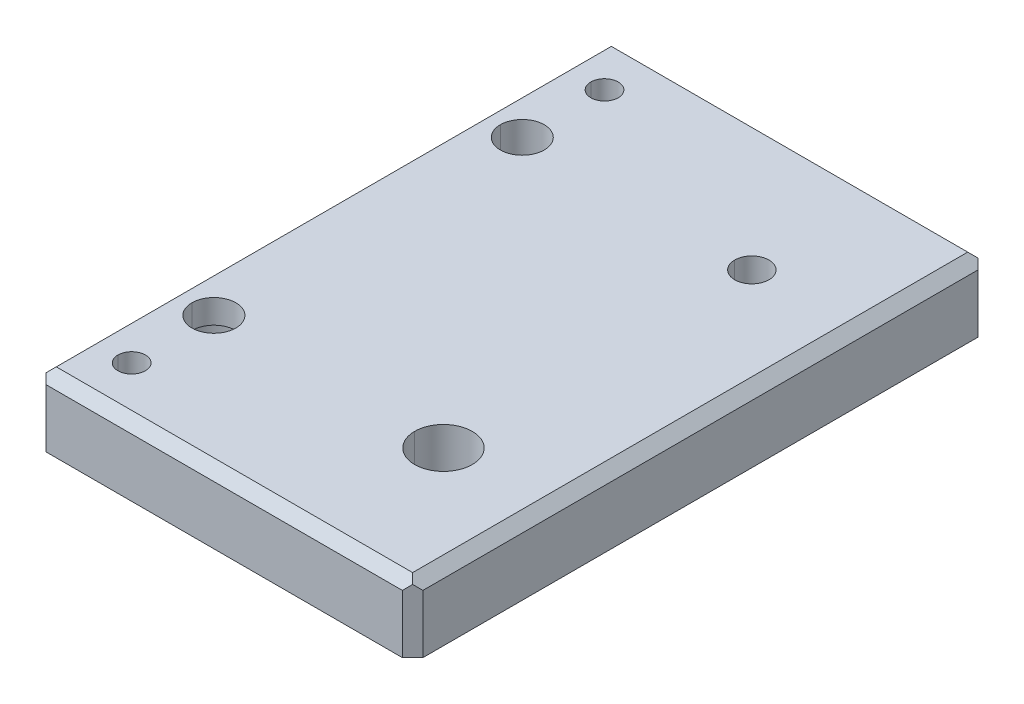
ISO-10303-21;
HEADER;
FILE_DESCRIPTION(('STEP AP214'),'2;1');
FILE_NAME('part.step','',(''),(''),'','','');
FILE_SCHEMA(('AUTOMOTIVE_DESIGN { 1 0 10303 214 1 1 1 1 }'));
ENDSEC;
DATA;
#1=APPLICATION_CONTEXT('core data for automotive mechanical design processes');
#2=APPLICATION_PROTOCOL_DEFINITION('international standard','automotive_design',2000,#1);
#3=PRODUCT_CONTEXT('',#1,'mechanical');
#4=PRODUCT('Part','Part','',(#3));
#5=PRODUCT_RELATED_PRODUCT_CATEGORY('part','',(#4));
#6=PRODUCT_DEFINITION_FORMATION('','',#4);
#7=PRODUCT_DEFINITION_CONTEXT('part definition',#1,'design');
#8=PRODUCT_DEFINITION('design','',#6,#7);
#9=PRODUCT_DEFINITION_SHAPE('','',#8);
#10=(LENGTH_UNIT() NAMED_UNIT(*) SI_UNIT(.MILLI.,.METRE.));
#11=(NAMED_UNIT(*) PLANE_ANGLE_UNIT() SI_UNIT($,.RADIAN.));
#12=(NAMED_UNIT(*) SI_UNIT($,.STERADIAN.) SOLID_ANGLE_UNIT());
#13=UNCERTAINTY_MEASURE_WITH_UNIT(LENGTH_MEASURE(1.E-05),#10,'distance_accuracy_value','');
#14=(GEOMETRIC_REPRESENTATION_CONTEXT(3) GLOBAL_UNCERTAINTY_ASSIGNED_CONTEXT((#13)) GLOBAL_UNIT_ASSIGNED_CONTEXT((#10,
#11,#12)) REPRESENTATION_CONTEXT('',''));
#15=CARTESIAN_POINT('',(0.,0.,0.));
#16=DIRECTION('',(0.,0.,1.));
#17=DIRECTION('',(1.,0.,0.));
#18=AXIS2_PLACEMENT_3D('',#15,#16,#17);
#19=CARTESIAN_POINT('',(-21.,6.55,22.5));
#20=DIRECTION('',(0.,-1.,0.));
#21=DIRECTION('',(-1.,0.,0.));
#22=AXIS2_PLACEMENT_3D('',#19,#20,#21);
#23=CYLINDRICAL_SURFACE('',#22,3.2);
#24=CARTESIAN_POINT('',(-17.8,5.,22.5));
#25=CARTESIAN_POINT('',(-17.8,5.,23.1362335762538));
#26=CARTESIAN_POINT('',(-18.0435854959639,5.,23.7245869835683));
#27=CARTESIAN_POINT('',(-18.2868595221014,5.,24.3121880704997));
#28=CARTESIAN_POINT('',(-18.737258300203,5.,24.7627416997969));
#29=CARTESIAN_POINT('',(-19.18687939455,5.,25.2125173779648));
#30=CARTESIAN_POINT('',(-19.7754130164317,5.,25.4564145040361));
#31=CARTESIAN_POINT('',(-20.3629304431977,5.,25.6998905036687));
#32=CARTESIAN_POINT('',(-21.,5.,25.7));
#33=CARTESIAN_POINT('',(-21.6359695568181,5.,25.7001093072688));
#34=CARTESIAN_POINT('',(-22.2245869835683,5.,25.4564145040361));
#35=CARTESIAN_POINT('',(-22.8121880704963,5.,25.2131404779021));
#36=CARTESIAN_POINT('',(-23.262741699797,5.,24.7627416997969));
#37=CARTESIAN_POINT('',(-23.7125173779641,5.,24.3131206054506));
#38=CARTESIAN_POINT('',(-23.9564145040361,5.,23.7245869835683));
#39=CARTESIAN_POINT('',(-24.2,5.,23.1368053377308));
#40=CARTESIAN_POINT('',(-24.2,5.,22.5));
#41=B_SPLINE_CURVE_WITH_KNOTS('',2,(#24,#25,#26,#27,#28,#29,#30,#31,#32,#33,#34,#35,#36,#37,#38,
#39,#40),.UNSPECIFIED.,.F.,.F.,(3,2,2,2,2,2,2,2,3),(0.,0.125,0.25,0.375,0.5,0.625,0.75,0.875,
1.),.UNSPECIFIED.);
#42=CARTESIAN_POINT('',(-17.8,5.,22.5));
#43=VERTEX_POINT('',#42);
#44=CARTESIAN_POINT('',(-24.2,5.,22.5));
#45=VERTEX_POINT('',#44);
#46=EDGE_CURVE('P0_E193',#43,#45,#41,.T.);
#47=ORIENTED_EDGE('',*,*,#46,.F.);
#48=CARTESIAN_POINT('',(-17.8,5.,22.5));
#49=DIRECTION('',(0.,-1.,0.));
#50=VECTOR('',#49,1.);
#51=LINE('',#48,#50);
#52=CARTESIAN_POINT('',(-17.8,1.5,22.5));
#53=VERTEX_POINT('',#52);
#54=EDGE_CURVE('P0_E204',#43,#53,#51,.T.);
#55=ORIENTED_EDGE('',*,*,#54,.T.);
#56=CARTESIAN_POINT('',(-21.,1.5,22.5));
#57=DIRECTION('',(0.,-1.,0.));
#58=DIRECTION('',(1.,0.,0.));
#59=AXIS2_PLACEMENT_3D('',#56,#57,#58);
#60=CIRCLE('',#59,3.2);
#61=CARTESIAN_POINT('',(-24.2,1.5,22.5));
#62=VERTEX_POINT('',#61);
#63=EDGE_CURVE('P0_E197',#53,#62,#60,.T.);
#64=ORIENTED_EDGE('',*,*,#63,.T.);
#65=CARTESIAN_POINT('',(-24.2,1.5,22.5));
#66=DIRECTION('',(0.,1.,0.));
#67=VECTOR('',#66,1.);
#68=LINE('',#65,#67);
#69=EDGE_CURVE('P0_E190',#62,#45,#68,.T.);
#70=ORIENTED_EDGE('',*,*,#69,.T.);
#71=EDGE_LOOP('',(#47,#55,#64,#70));
#72=FACE_BOUND('',#71,.T.);
#73=ADVANCED_FACE('P0_F16',(#72),#23,.F.);
#74=CARTESIAN_POINT('',(-21.,6.55,22.5));
#75=DIRECTION('',(0.,-1.,0.));
#76=DIRECTION('',(-1.,0.,0.));
#77=AXIS2_PLACEMENT_3D('',#74,#75,#76);
#78=CYLINDRICAL_SURFACE('',#77,3.2);
#79=CARTESIAN_POINT('',(-24.2,5.,22.5));
#80=CARTESIAN_POINT('',(-24.2,5.,21.8637664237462));
#81=CARTESIAN_POINT('',(-23.9564145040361,5.,21.2754130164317));
#82=CARTESIAN_POINT('',(-23.7131404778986,5.,20.6878119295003));
#83=CARTESIAN_POINT('',(-23.262741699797,5.,20.2372583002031));
#84=CARTESIAN_POINT('',(-22.81312060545,5.,19.7874826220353));
#85=CARTESIAN_POINT('',(-22.2245869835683,5.,19.5435854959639));
#86=CARTESIAN_POINT('',(-21.6370695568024,5.,19.3001094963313));
#87=CARTESIAN_POINT('',(-21.,5.,19.3));
#88=CARTESIAN_POINT('',(-20.3640304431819,5.,19.2998906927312));
#89=CARTESIAN_POINT('',(-19.7754130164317,5.,19.5435854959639));
#90=CARTESIAN_POINT('',(-19.1878119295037,5.,19.7868595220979));
#91=CARTESIAN_POINT('',(-18.737258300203,5.,20.2372583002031));
#92=CARTESIAN_POINT('',(-18.2874826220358,5.,20.6868793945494));
#93=CARTESIAN_POINT('',(-18.0435854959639,5.,21.2754130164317));
#94=CARTESIAN_POINT('',(-17.8,5.,21.8631946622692));
#95=CARTESIAN_POINT('',(-17.8,5.,22.5));
#96=B_SPLINE_CURVE_WITH_KNOTS('',2,(#79,#80,#81,#82,#83,#84,#85,#86,#87,#88,#89,#90,#91,#92,#93,
#94,#95),.UNSPECIFIED.,.F.,.F.,(3,2,2,2,2,2,2,2,3),(0.,0.125,0.25,0.375,0.5,0.625,0.75,0.875,
1.),.UNSPECIFIED.);
#97=EDGE_CURVE('P0_E207',#45,#43,#96,.T.);
#98=ORIENTED_EDGE('',*,*,#97,.F.);
#99=ORIENTED_EDGE('',*,*,#69,.F.);
#100=CARTESIAN_POINT('',(-21.,1.5,22.5));
#101=DIRECTION('',(0.,-1.,0.));
#102=DIRECTION('',(-1.,0.,0.));
#103=AXIS2_PLACEMENT_3D('',#100,#101,#102);
#104=CIRCLE('',#103,3.2);
#105=EDGE_CURVE('P0_E623',#62,#53,#104,.T.);
#106=ORIENTED_EDGE('',*,*,#105,.T.);
#107=ORIENTED_EDGE('',*,*,#54,.F.);
#108=EDGE_LOOP('',(#98,#99,#106,#107));
#109=FACE_BOUND('',#108,.T.);
#110=ADVANCED_FACE('P0_F209',(#109),#78,.F.);
#111=CARTESIAN_POINT('',(-21.,1.5,22.5));
#112=DIRECTION('',(0.,1.,0.));
#113=DIRECTION('',(1.,0.,0.));
#114=AXIS2_PLACEMENT_3D('',#111,#112,#113);
#115=PLANE('',#114);
#116=CARTESIAN_POINT('',(-15.5,1.5,22.5));
#117=CARTESIAN_POINT('',(-15.5,1.5,23.0419802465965));
#118=CARTESIAN_POINT('',(-15.6056809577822,1.5,23.5729967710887));
#119=CARTESIAN_POINT('',(-15.7115223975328,1.5,24.1048196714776));
#120=CARTESIAN_POINT('',(-15.9186625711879,1.5,24.604758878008));
#121=CARTESIAN_POINT('',(-16.1262237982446,1.5,25.1057143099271));
#122=CARTESIAN_POINT('',(-16.426917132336,1.5,25.5556362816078));
#123=CARTESIAN_POINT('',(-16.7282216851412,1.5,26.006472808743));
#124=CARTESIAN_POINT('',(-17.110912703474,1.5,26.389087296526));
#125=CARTESIAN_POINT('',(-17.4943816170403,1.5,26.7724795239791));
#126=CARTESIAN_POINT('',(-17.9443637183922,1.5,27.073082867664));
#127=CARTESIAN_POINT('',(-18.3952604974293,1.5,27.374297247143));
#128=CARTESIAN_POINT('',(-18.895241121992,1.5,27.5813374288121));
#129=CARTESIAN_POINT('',(-19.3962380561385,1.5,27.7887984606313));
#130=CARTESIAN_POINT('',(-19.9270032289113,1.5,27.8943190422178));
#131=CARTESIAN_POINT('',(-20.458847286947,1.5,28.000054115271));
#132=CARTESIAN_POINT('',(-21.,1.5,28.));
#133=CARTESIAN_POINT('',(-21.5422527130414,1.5,27.999945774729));
#134=CARTESIAN_POINT('',(-22.0729967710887,1.5,27.8943190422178));
#135=CARTESIAN_POINT('',(-22.6048196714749,1.5,27.7884776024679));
#136=CARTESIAN_POINT('',(-23.104758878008,1.5,27.5813374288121));
#137=CARTESIAN_POINT('',(-23.6057143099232,1.5,27.3737762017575));
#138=CARTESIAN_POINT('',(-24.0556362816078,1.5,27.073082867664));
#139=CARTESIAN_POINT('',(-24.5064728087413,1.5,26.7717783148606));
#140=CARTESIAN_POINT('',(-24.889087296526,1.5,26.389087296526));
#141=CARTESIAN_POINT('',(-25.2724795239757,1.5,26.0056183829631));
#142=CARTESIAN_POINT('',(-25.573082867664,1.5,25.5556362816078));
#143=CARTESIAN_POINT('',(-25.8742972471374,1.5,25.1047395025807));
#144=CARTESIAN_POINT('',(-26.0813374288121,1.5,24.604758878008));
#145=CARTESIAN_POINT('',(-26.2887984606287,1.5,24.1037619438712));
#146=CARTESIAN_POINT('',(-26.3943190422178,1.5,23.5729967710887));
#147=CARTESIAN_POINT('',(-26.5,1.5,23.0414249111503));
#148=CARTESIAN_POINT('',(-26.5,1.5,22.5));
#149=B_SPLINE_CURVE_WITH_KNOTS('',2,(#116,#117,#118,#119,#120,#121,#122,#123,#124,#125,#126,
#127,#128,#129,#130,#131,#132,#133,#134,#135,#136,#137,#138,#139,#140,#141,#142,#143,#144,#145,
#146,#147,#148),.UNSPECIFIED.,.F.,.F.,(3,2,2,2,2,2,2,2,2,2,2,2,2,2,2,2,3),(0.,0.0625,0.125,
0.1875,0.25,0.3125,0.375,0.4375,0.5,0.5625,0.625,0.6875,0.75,0.8125,0.875,0.9375,1.),.UNSPECIFIED.);
#150=CARTESIAN_POINT('',(-15.5,1.5,22.5));
#151=VERTEX_POINT('',#150);
#152=CARTESIAN_POINT('',(-26.5,1.5,22.5));
#153=VERTEX_POINT('',#152);
#154=EDGE_CURVE('P0_E1880',#151,#153,#149,.T.);
#155=ORIENTED_EDGE('',*,*,#154,.T.);
#156=CARTESIAN_POINT('',(-26.5,1.5,22.5));
#157=CARTESIAN_POINT('',(-26.5,1.5,21.9580197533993));
#158=CARTESIAN_POINT('',(-26.3943190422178,1.5,21.4270032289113));
#159=CARTESIAN_POINT('',(-26.2884776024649,1.5,20.8951803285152));
#160=CARTESIAN_POINT('',(-26.0813374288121,1.5,20.395241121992));
#161=CARTESIAN_POINT('',(-25.8737762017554,1.5,19.8942856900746));
#162=CARTESIAN_POINT('',(-25.573082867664,1.5,19.4443637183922));
#163=CARTESIAN_POINT('',(-25.2717783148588,1.5,18.9935271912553));
#164=CARTESIAN_POINT('',(-24.889087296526,1.5,18.610912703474));
#165=CARTESIAN_POINT('',(-24.5056183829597,1.5,18.2275204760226));
#166=CARTESIAN_POINT('',(-24.0556362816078,1.5,17.926917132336));
#167=CARTESIAN_POINT('',(-23.6047395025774,1.5,17.6257027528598));
#168=CARTESIAN_POINT('',(-23.104758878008,1.5,17.4186625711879));
#169=CARTESIAN_POINT('',(-22.6037619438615,1.5,17.2112015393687));
#170=CARTESIAN_POINT('',(-22.0729967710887,1.5,17.1056809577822));
#171=CARTESIAN_POINT('',(-21.541152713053,1.5,16.999945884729));
#172=CARTESIAN_POINT('',(-21.,1.5,17.));
#173=CARTESIAN_POINT('',(-20.4577472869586,1.5,17.000054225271));
#174=CARTESIAN_POINT('',(-19.9270032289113,1.5,17.1056809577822));
#175=CARTESIAN_POINT('',(-19.3951803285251,1.5,17.2115223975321));
#176=CARTESIAN_POINT('',(-18.895241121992,1.5,17.4186625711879));
#177=CARTESIAN_POINT('',(-18.3942856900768,1.5,17.6262237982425));
#178=CARTESIAN_POINT('',(-17.9443637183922,1.5,17.926917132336));
#179=CARTESIAN_POINT('',(-17.4935271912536,1.5,18.2282216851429));
#180=CARTESIAN_POINT('',(-17.110912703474,1.5,18.610912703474));
#181=CARTESIAN_POINT('',(-16.7275204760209,1.5,18.9943816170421));
#182=CARTESIAN_POINT('',(-16.426917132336,1.5,19.4443637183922));
#183=CARTESIAN_POINT('',(-16.1257027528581,1.5,19.895260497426));
#184=CARTESIAN_POINT('',(-15.9186625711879,1.5,20.395241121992));
#185=CARTESIAN_POINT('',(-15.7112015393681,1.5,20.8962380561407));
#186=CARTESIAN_POINT('',(-15.6056809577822,1.5,21.4270032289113));
#187=CARTESIAN_POINT('',(-15.5,1.5,21.958575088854));
#188=CARTESIAN_POINT('',(-15.5,1.5,22.5));
#189=B_SPLINE_CURVE_WITH_KNOTS('',2,(#156,#157,#158,#159,#160,#161,#162,#163,#164,#165,#166,
#167,#168,#169,#170,#171,#172,#173,#174,#175,#176,#177,#178,#179,#180,#181,#182,#183,#184,#185,
#186,#187,#188),.UNSPECIFIED.,.F.,.F.,(3,2,2,2,2,2,2,2,2,2,2,2,2,2,2,2,3),(0.,0.0625,0.125,
0.1875,0.25,0.3125,0.375,0.4375,0.5,0.5625,0.625,0.6875,0.75,0.8125,0.875,0.9375,1.),.UNSPECIFIED.);
#190=EDGE_CURVE('P0_E655',#153,#151,#189,.T.);
#191=ORIENTED_EDGE('',*,*,#190,.T.);
#192=EDGE_LOOP('',(#155,#191));
#193=FACE_BOUND('',#192,.T.);
#194=ORIENTED_EDGE('',*,*,#105,.F.);
#195=ORIENTED_EDGE('',*,*,#63,.F.);
#196=EDGE_LOOP('',(#194,#195));
#197=FACE_BOUND('',#196,.T.);
#198=ADVANCED_FACE('P0_F628',(#193,#197),#115,.F.);
#199=CARTESIAN_POINT('',(26.75,4.25,0.));
#200=DIRECTION('',(0.707106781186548,0.707106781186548,0.));
#201=DIRECTION('',(0.,0.,-1.));
#202=AXIS2_PLACEMENT_3D('',#199,#200,#201);
#203=PLANE('',#202);
#204=CARTESIAN_POINT('',(27.5,3.49999999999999,40.5));
#205=DIRECTION('',(-0.577350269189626,0.577350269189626,0.577350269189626));
#206=VECTOR('',#205,1.);
#207=LINE('',#204,#206);
#208=CARTESIAN_POINT('',(27.5,3.5,40.5));
#209=VERTEX_POINT('',#208);
#210=CARTESIAN_POINT('',(26.75,4.25,41.25));
#211=VERTEX_POINT('',#210);
#212=EDGE_CURVE('P0_E460',#209,#211,#207,.T.);
#213=ORIENTED_EDGE('',*,*,#212,.F.);
#214=CARTESIAN_POINT('',(27.5,3.5,-40.5));
#215=DIRECTION('',(0.,0.,1.));
#216=VECTOR('',#215,1.);
#217=LINE('',#214,#216);
#218=CARTESIAN_POINT('',(27.5,3.5,-40.5));
#219=VERTEX_POINT('',#218);
#220=EDGE_CURVE('P0_E611',#219,#209,#217,.T.);
#221=ORIENTED_EDGE('',*,*,#220,.F.);
#222=CARTESIAN_POINT('',(27.5,3.5,-40.5));
#223=DIRECTION('',(-0.577350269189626,0.577350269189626,-0.577350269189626));
#224=VECTOR('',#223,1.);
#225=LINE('',#222,#224);
#226=CARTESIAN_POINT('',(26.75,4.25,-41.25));
#227=VERTEX_POINT('',#226);
#228=EDGE_CURVE('P0_E560',#219,#227,#225,.T.);
#229=ORIENTED_EDGE('',*,*,#228,.T.);
#230=CARTESIAN_POINT('',(26.75,4.25,-41.25));
#231=DIRECTION('',(-0.577350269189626,0.577350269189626,0.577350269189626));
#232=VECTOR('',#231,1.);
#233=LINE('',#230,#232);
#234=CARTESIAN_POINT('',(26.,5.,-40.5));
#235=VERTEX_POINT('',#234);
#236=EDGE_CURVE('P0_E571',#227,#235,#233,.T.);
#237=ORIENTED_EDGE('',*,*,#236,.T.);
#238=CARTESIAN_POINT('',(26.,5.,40.5));
#239=DIRECTION('',(0.,0.,-1.));
#240=VECTOR('',#239,1.);
#241=LINE('',#238,#240);
#242=CARTESIAN_POINT('',(26.,5.,40.5));
#243=VERTEX_POINT('',#242);
#244=EDGE_CURVE('P0_E221',#243,#235,#241,.T.);
#245=ORIENTED_EDGE('',*,*,#244,.F.);
#246=CARTESIAN_POINT('',(26.7500000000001,4.25,41.25));
#247=DIRECTION('',(-0.577350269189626,0.577350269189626,-0.577350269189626));
#248=VECTOR('',#247,1.);
#249=LINE('',#246,#248);
#250=EDGE_CURVE('P0_E592',#211,#243,#249,.T.);
#251=ORIENTED_EDGE('',*,*,#250,.F.);
#252=EDGE_LOOP('',(#213,#221,#229,#237,#245,#251));
#253=FACE_BOUND('',#252,.T.);
#254=ADVANCED_FACE('P0_F518',(#253),#203,.T.);
#255=CARTESIAN_POINT('',(1.278976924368E-13,4.25,41.25));
#256=DIRECTION('',(0.,0.707106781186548,0.707106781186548));
#257=DIRECTION('',(1.,0.,0.));
#258=AXIS2_PLACEMENT_3D('',#255,#256,#257);
#259=PLANE('',#258);
#260=CARTESIAN_POINT('',(-26.,3.49999999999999,42.));
#261=DIRECTION('',(-0.577350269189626,0.577350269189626,-0.577350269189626));
#262=VECTOR('',#261,1.);
#263=LINE('',#260,#262);
#264=CARTESIAN_POINT('',(-26.,3.5,42.));
#265=VERTEX_POINT('',#264);
#266=CARTESIAN_POINT('',(-26.75,4.25,41.25));
#267=VERTEX_POINT('',#266);
#268=EDGE_CURVE('P0_E346',#265,#267,#263,.T.);
#269=ORIENTED_EDGE('',*,*,#268,.F.);
#270=CARTESIAN_POINT('',(26.,3.5,42.));
#271=DIRECTION('',(-1.,0.,0.));
#272=VECTOR('',#271,1.);
#273=LINE('',#270,#272);
#274=CARTESIAN_POINT('',(26.,3.5,42.));
#275=VERTEX_POINT('',#274);
#276=EDGE_CURVE('P0_E547',#275,#265,#273,.T.);
#277=ORIENTED_EDGE('',*,*,#276,.F.);
#278=CARTESIAN_POINT('',(26.75,4.24999999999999,41.25));
#279=DIRECTION('',(-0.577350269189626,-0.577350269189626,0.577350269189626));
#280=VECTOR('',#279,1.);
#281=LINE('',#278,#280);
#282=EDGE_CURVE('P0_E472',#211,#275,#281,.T.);
#283=ORIENTED_EDGE('',*,*,#282,.F.);
#284=ORIENTED_EDGE('',*,*,#250,.T.);
#285=CARTESIAN_POINT('',(-26.,5.,40.5));
#286=DIRECTION('',(1.,0.,0.));
#287=VECTOR('',#286,1.);
#288=LINE('',#285,#287);
#289=CARTESIAN_POINT('',(-26.,5.,40.5));
#290=VERTEX_POINT('',#289);
#291=EDGE_CURVE('P0_E730',#290,#243,#288,.T.);
#292=ORIENTED_EDGE('',*,*,#291,.F.);
#293=CARTESIAN_POINT('',(-26.75,4.25,41.25));
#294=DIRECTION('',(0.577350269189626,0.577350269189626,-0.577350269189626));
#295=VECTOR('',#294,1.);
#296=LINE('',#293,#295);
#297=EDGE_CURVE('P0_E702',#267,#290,#296,.T.);
#298=ORIENTED_EDGE('',*,*,#297,.F.);
#299=EDGE_LOOP('',(#269,#277,#283,#284,#292,#298));
#300=FACE_BOUND('',#299,.T.);
#301=ADVANCED_FACE('P0_F509',(#300),#259,.T.);
#302=CARTESIAN_POINT('',(26.75,0.,41.25));
#303=DIRECTION('',(0.707106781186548,0.,0.707106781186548));
#304=DIRECTION('',(0.,-1.,0.));
#305=AXIS2_PLACEMENT_3D('',#302,#303,#304);
#306=PLANE('',#305);
#307=CARTESIAN_POINT('',(26.,-5.,42.));
#308=DIRECTION('',(0.,1.,0.));
#309=VECTOR('',#308,1.);
#310=LINE('',#307,#309);
#311=CARTESIAN_POINT('',(26.,-5.,42.));
#312=VERTEX_POINT('',#311);
#313=EDGE_CURVE('P0_E483',#312,#275,#310,.T.);
#314=ORIENTED_EDGE('',*,*,#313,.F.);
#315=CARTESIAN_POINT('',(26.,-5.00000000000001,42.));
#316=DIRECTION('',(0.707106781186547,0.,-0.707106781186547));
#317=VECTOR('',#316,1.);
#318=LINE('',#315,#317);
#319=CARTESIAN_POINT('',(27.5,-5.,40.5));
#320=VERTEX_POINT('',#319);
#321=EDGE_CURVE('P0_E494',#312,#320,#318,.T.);
#322=ORIENTED_EDGE('',*,*,#321,.T.);
#323=CARTESIAN_POINT('',(27.5,3.5,40.5));
#324=DIRECTION('',(0.,-1.,0.));
#325=VECTOR('',#324,1.);
#326=LINE('',#323,#325);
#327=EDGE_CURVE('P0_E448',#209,#320,#326,.T.);
#328=ORIENTED_EDGE('',*,*,#327,.F.);
#329=ORIENTED_EDGE('',*,*,#212,.T.);
#330=ORIENTED_EDGE('',*,*,#282,.T.);
#331=EDGE_LOOP('',(#314,#322,#328,#329,#330));
#332=FACE_BOUND('',#331,.T.);
#333=ADVANCED_FACE('P0_F404',(#332),#306,.T.);
#334=CARTESIAN_POINT('',(-26.75,4.25,0.));
#335=DIRECTION('',(-0.707106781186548,0.707106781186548,0.));
#336=DIRECTION('',(0.,0.,1.));
#337=AXIS2_PLACEMENT_3D('',#334,#335,#336);
#338=PLANE('',#337);
#339=CARTESIAN_POINT('',(-26.75,4.25,-41.25));
#340=DIRECTION('',(-0.577350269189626,-0.577350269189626,0.577350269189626));
#341=VECTOR('',#340,1.);
#342=LINE('',#339,#341);
#343=CARTESIAN_POINT('',(-26.75,4.25,-41.25));
#344=VERTEX_POINT('',#343);
#345=CARTESIAN_POINT('',(-27.5,3.5,-40.5));
#346=VERTEX_POINT('',#345);
#347=EDGE_CURVE('P0_E712',#344,#346,#342,.T.);
#348=ORIENTED_EDGE('',*,*,#347,.T.);
#349=CARTESIAN_POINT('',(-27.5,3.5,40.5));
#350=DIRECTION('',(0.,0.,-1.));
#351=VECTOR('',#350,1.);
#352=LINE('',#349,#351);
#353=CARTESIAN_POINT('',(-27.5,3.5,40.5));
#354=VERTEX_POINT('',#353);
#355=EDGE_CURVE('P0_E434',#354,#346,#352,.T.);
#356=ORIENTED_EDGE('',*,*,#355,.F.);
#357=CARTESIAN_POINT('',(-26.75,4.24999999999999,41.25));
#358=DIRECTION('',(-0.577350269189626,-0.577350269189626,-0.577350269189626));
#359=VECTOR('',#358,1.);
#360=LINE('',#357,#359);
#361=EDGE_CURVE('P0_E358',#267,#354,#360,.T.);
#362=ORIENTED_EDGE('',*,*,#361,.F.);
#363=ORIENTED_EDGE('',*,*,#297,.T.);
#364=CARTESIAN_POINT('',(-26.,5.,-40.5));
#365=DIRECTION('',(0.,0.,1.));
#366=VECTOR('',#365,1.);
#367=LINE('',#364,#366);
#368=CARTESIAN_POINT('',(-26.,5.,-40.5));
#369=VERTEX_POINT('',#368);
#370=EDGE_CURVE('P0_E725',#369,#290,#367,.T.);
#371=ORIENTED_EDGE('',*,*,#370,.F.);
#372=CARTESIAN_POINT('',(-26.,5.,-40.5));
#373=DIRECTION('',(-0.577350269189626,-0.577350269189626,-0.577350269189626));
#374=VECTOR('',#373,1.);
#375=LINE('',#372,#374);
#376=EDGE_CURVE('P0_E706',#369,#344,#375,.T.);
#377=ORIENTED_EDGE('',*,*,#376,.T.);
#378=EDGE_LOOP('',(#348,#356,#362,#363,#371,#377));
#379=FACE_BOUND('',#378,.T.);
#380=ADVANCED_FACE('P0_F395',(#379),#338,.T.);
#381=CARTESIAN_POINT('',(-26.75,0.,41.25));
#382=DIRECTION('',(-0.707106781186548,0.,0.707106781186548));
#383=DIRECTION('',(0.,1.,0.));
#384=AXIS2_PLACEMENT_3D('',#381,#382,#383);
#385=PLANE('',#384);
#386=CARTESIAN_POINT('',(-27.5,-5.,40.5));
#387=DIRECTION('',(0.,1.,0.));
#388=VECTOR('',#387,1.);
#389=LINE('',#386,#388);
#390=CARTESIAN_POINT('',(-27.5,-5.,40.5));
#391=VERTEX_POINT('',#390);
#392=EDGE_CURVE('P0_E369',#391,#354,#389,.T.);
#393=ORIENTED_EDGE('',*,*,#392,.F.);
#394=CARTESIAN_POINT('',(-27.5,-5.00000000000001,40.5));
#395=DIRECTION('',(0.707106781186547,0.,0.707106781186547));
#396=VECTOR('',#395,1.);
#397=LINE('',#394,#396);
#398=CARTESIAN_POINT('',(-26.,-5.,42.));
#399=VERTEX_POINT('',#398);
#400=EDGE_CURVE('P0_E380',#391,#399,#397,.T.);
#401=ORIENTED_EDGE('',*,*,#400,.T.);
#402=CARTESIAN_POINT('',(-26.,3.5,42.));
#403=DIRECTION('',(0.,-1.,0.));
#404=VECTOR('',#403,1.);
#405=LINE('',#402,#404);
#406=EDGE_CURVE('P0_E334',#265,#399,#405,.T.);
#407=ORIENTED_EDGE('',*,*,#406,.F.);
#408=ORIENTED_EDGE('',*,*,#268,.T.);
#409=ORIENTED_EDGE('',*,*,#361,.T.);
#410=EDGE_LOOP('',(#393,#401,#407,#408,#409));
#411=FACE_BOUND('',#410,.T.);
#412=ADVANCED_FACE('P0_F241',(#411),#385,.T.);
#413=CARTESIAN_POINT('',(0.,5.,0.));
#414=DIRECTION('',(0.,1.,0.));
#415=DIRECTION('',(1.,0.,0.));
#416=AXIS2_PLACEMENT_3D('',#413,#414,#415);
#417=PLANE('',#416);
#418=CARTESIAN_POINT('',(-23.,5.,34.5));
#419=CARTESIAN_POINT('',(-23.,5.,34.1024613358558));
#420=CARTESIAN_POINT('',(-22.8477590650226,5.,33.7346331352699));
#421=CARTESIAN_POINT('',(-22.6958295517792,5.,33.3675573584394));
#422=CARTESIAN_POINT('',(-22.4142135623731,5.,33.0857864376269));
#423=CARTESIAN_POINT('',(-22.1333751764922,5.,32.8047935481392));
#424=CARTESIAN_POINT('',(-21.7653668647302,5.,32.6522409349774));
#425=CARTESIAN_POINT('',(-21.3983747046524,5.,32.5001095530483));
#426=CARTESIAN_POINT('',(-21.,5.,32.5));
#427=CARTESIAN_POINT('',(-20.6027252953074,5.,32.4998907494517));
#428=CARTESIAN_POINT('',(-20.2346331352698,5.,32.6522409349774));
#429=CARTESIAN_POINT('',(-19.8675573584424,5.,32.8041704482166));
#430=CARTESIAN_POINT('',(-19.5857864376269,5.,33.0857864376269));
#431=CARTESIAN_POINT('',(-19.3047935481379,5.,33.3666248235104));
#432=CARTESIAN_POINT('',(-19.1522409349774,5.,33.7346331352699));
#433=CARTESIAN_POINT('',(-19.,5.,34.1018895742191));
#434=CARTESIAN_POINT('',(-19.,5.,34.5));
#435=B_SPLINE_CURVE_WITH_KNOTS('',2,(#418,#419,#420,#421,#422,#423,#424,#425,#426,#427,#428,
#429,#430,#431,#432,#433,#434),.UNSPECIFIED.,.F.,.F.,(3,2,2,2,2,2,2,2,3),(0.,0.125,0.25,0.375,
0.5,0.625,0.75,0.875,1.),.UNSPECIFIED.);
#436=CARTESIAN_POINT('',(-23.,5.,34.5));
#437=VERTEX_POINT('',#436);
#438=CARTESIAN_POINT('',(-19.,5.,34.5));
#439=VERTEX_POINT('',#438);
#440=EDGE_CURVE('P0_E1709',#437,#439,#435,.T.);
#441=ORIENTED_EDGE('',*,*,#440,.T.);
#442=CARTESIAN_POINT('',(-19.,5.,34.5));
#443=CARTESIAN_POINT('',(-19.,5.,34.8975386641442));
#444=CARTESIAN_POINT('',(-19.1522409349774,5.,35.2653668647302));
#445=CARTESIAN_POINT('',(-19.3041704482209,5.,35.6324426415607));
#446=CARTESIAN_POINT('',(-19.5857864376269,5.,35.9142135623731));
#447=CARTESIAN_POINT('',(-19.8666248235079,5.,36.1952064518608));
#448=CARTESIAN_POINT('',(-20.2346331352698,5.,36.3477590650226));
#449=CARTESIAN_POINT('',(-20.6016252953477,5.,36.4998904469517));
#450=CARTESIAN_POINT('',(-21.,5.,36.5));
#451=CARTESIAN_POINT('',(-21.3972747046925,5.,36.5001092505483));
#452=CARTESIAN_POINT('',(-21.7653668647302,5.,36.3477590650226));
#453=CARTESIAN_POINT('',(-22.1324426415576,5.,36.1958295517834));
#454=CARTESIAN_POINT('',(-22.4142135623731,5.,35.9142135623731));
#455=CARTESIAN_POINT('',(-22.6952064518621,5.,35.6333751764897));
#456=CARTESIAN_POINT('',(-22.8477590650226,5.,35.2653668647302));
#457=CARTESIAN_POINT('',(-23.,5.,34.8981104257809));
#458=CARTESIAN_POINT('',(-23.,5.,34.5));
#459=B_SPLINE_CURVE_WITH_KNOTS('',2,(#442,#443,#444,#445,#446,#447,#448,#449,#450,#451,#452,
#453,#454,#455,#456,#457,#458),.UNSPECIFIED.,.F.,.F.,(3,2,2,2,2,2,2,2,3),(0.,0.125,0.25,0.375,
0.5,0.625,0.75,0.875,1.),.UNSPECIFIED.);
#460=EDGE_CURVE('P0_E214',#439,#437,#459,.T.);
#461=ORIENTED_EDGE('',*,*,#460,.T.);
#462=EDGE_LOOP('',(#441,#461));
#463=FACE_BOUND('',#462,.T.);
#464=CARTESIAN_POINT('',(15.,5.,-22.5));
#465=CARTESIAN_POINT('',(15.,5.,-22.0030051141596));
#466=CARTESIAN_POINT('',(14.8096988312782,5.,-21.5432914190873));
#467=CARTESIAN_POINT('',(14.6197091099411,5.,-21.0843300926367));
#468=CARTESIAN_POINT('',(14.2677669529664,5.,-20.7322330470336));
#469=CARTESIAN_POINT('',(13.9166024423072,5.,-20.3809139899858));
#470=CARTESIAN_POINT('',(13.4567085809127,5.,-20.1903011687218));
#471=CARTESIAN_POINT('',(12.997830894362,5.,-20.0001095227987));
#472=CARTESIAN_POINT('',(12.5,5.,-20.));
#473=CARTESIAN_POINT('',(12.0032691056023,5.,-19.9998907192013));
#474=CARTESIAN_POINT('',(11.5432914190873,5.,-20.1903011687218));
#475=CARTESIAN_POINT('',(11.0843300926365,5.,-20.3802908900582));
#476=CARTESIAN_POINT('',(10.7322330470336,5.,-20.7322330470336));
#477=CARTESIAN_POINT('',(10.380913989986,5.,-21.0833975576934));
#478=CARTESIAN_POINT('',(10.1903011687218,5.,-21.5432914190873));
#479=CARTESIAN_POINT('',(10.,5.,-22.0024333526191));
#480=CARTESIAN_POINT('',(10.,5.,-22.5));
#481=B_SPLINE_CURVE_WITH_KNOTS('',2,(#464,#465,#466,#467,#468,#469,#470,#471,#472,#473,#474,
#475,#476,#477,#478,#479,#480),.UNSPECIFIED.,.F.,.F.,(3,2,2,2,2,2,2,2,3),(0.,0.125,0.25,0.375,
0.5,0.625,0.75,0.875,1.),.UNSPECIFIED.);
#482=CARTESIAN_POINT('',(15.,5.,-22.5));
#483=VERTEX_POINT('',#482);
#484=CARTESIAN_POINT('',(10.,5.,-22.5));
#485=VERTEX_POINT('',#484);
#486=EDGE_CURVE('P0_E1748',#483,#485,#481,.T.);
#487=ORIENTED_EDGE('',*,*,#486,.T.);
#488=CARTESIAN_POINT('',(10.,5.,-22.5));
#489=CARTESIAN_POINT('',(10.,5.,-22.9969948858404));
#490=CARTESIAN_POINT('',(10.1903011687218,5.,-23.4567085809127));
#491=CARTESIAN_POINT('',(10.3802908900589,5.,-23.9156699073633));
#492=CARTESIAN_POINT('',(10.7322330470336,5.,-24.2677669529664));
#493=CARTESIAN_POINT('',(11.0833975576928,5.,-24.6190860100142));
#494=CARTESIAN_POINT('',(11.5432914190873,5.,-24.8096988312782));
#495=CARTESIAN_POINT('',(12.002169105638,5.,-24.9998904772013));
#496=CARTESIAN_POINT('',(12.5,5.,-25.));
#497=CARTESIAN_POINT('',(12.9967308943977,5.,-25.0001092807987));
#498=CARTESIAN_POINT('',(13.4567085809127,5.,-24.8096988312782));
#499=CARTESIAN_POINT('',(13.9156699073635,5.,-24.6197091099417));
#500=CARTESIAN_POINT('',(14.2677669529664,5.,-24.2677669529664));
#501=CARTESIAN_POINT('',(14.619086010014,5.,-23.9166024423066));
#502=CARTESIAN_POINT('',(14.8096988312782,5.,-23.4567085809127));
#503=CARTESIAN_POINT('',(15.,5.,-22.9975666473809));
#504=CARTESIAN_POINT('',(15.,5.,-22.5));
#505=B_SPLINE_CURVE_WITH_KNOTS('',2,(#488,#489,#490,#491,#492,#493,#494,#495,#496,#497,#498,
#499,#500,#501,#502,#503,#504),.UNSPECIFIED.,.F.,.F.,(3,2,2,2,2,2,2,2,3),(0.,0.125,0.25,0.375,
0.5,0.625,0.75,0.875,1.),.UNSPECIFIED.);
#506=EDGE_CURVE('P0_E1724',#485,#483,#505,.T.);
#507=ORIENTED_EDGE('',*,*,#506,.T.);
#508=EDGE_LOOP('',(#487,#507));
#509=FACE_BOUND('',#508,.T.);
#510=CARTESIAN_POINT('',(-17.8,5.,-22.5));
#511=CARTESIAN_POINT('',(-17.8,5.,-21.8637664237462));
#512=CARTESIAN_POINT('',(-18.0435854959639,5.,-21.2754130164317));
#513=CARTESIAN_POINT('',(-18.2868595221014,5.,-20.6878119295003));
#514=CARTESIAN_POINT('',(-18.737258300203,5.,-20.2372583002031));
#515=CARTESIAN_POINT('',(-19.18687939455,5.,-19.7874826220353));
#516=CARTESIAN_POINT('',(-19.7754130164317,5.,-19.5435854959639));
#517=CARTESIAN_POINT('',(-20.3629304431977,5.,-19.3001094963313));
#518=CARTESIAN_POINT('',(-21.,5.,-19.3));
#519=CARTESIAN_POINT('',(-21.6359695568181,5.,-19.2998906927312));
#520=CARTESIAN_POINT('',(-22.2245869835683,5.,-19.5435854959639));
#521=CARTESIAN_POINT('',(-22.8121880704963,5.,-19.7868595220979));
#522=CARTESIAN_POINT('',(-23.262741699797,5.,-20.2372583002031));
#523=CARTESIAN_POINT('',(-23.7125173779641,5.,-20.6868793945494));
#524=CARTESIAN_POINT('',(-23.9564145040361,5.,-21.2754130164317));
#525=CARTESIAN_POINT('',(-24.2,5.,-21.8631946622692));
#526=CARTESIAN_POINT('',(-24.2,5.,-22.5));
#527=B_SPLINE_CURVE_WITH_KNOTS('',2,(#510,#511,#512,#513,#514,#515,#516,#517,#518,#519,#520,
#521,#522,#523,#524,#525,#526),.UNSPECIFIED.,.F.,.F.,(3,2,2,2,2,2,2,2,3),(0.,0.125,0.25,0.375,
0.5,0.625,0.75,0.875,1.),.UNSPECIFIED.);
#528=CARTESIAN_POINT('',(-17.8,5.,-22.5));
#529=VERTEX_POINT('',#528);
#530=CARTESIAN_POINT('',(-24.2,5.,-22.5));
#531=VERTEX_POINT('',#530);
#532=EDGE_CURVE('P0_E1775',#529,#531,#527,.T.);
#533=ORIENTED_EDGE('',*,*,#532,.T.);
#534=CARTESIAN_POINT('',(-24.2,5.,-22.5));
#535=CARTESIAN_POINT('',(-24.2,5.,-23.1362335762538));
#536=CARTESIAN_POINT('',(-23.9564145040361,5.,-23.7245869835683));
#537=CARTESIAN_POINT('',(-23.7131404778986,5.,-24.3121880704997));
#538=CARTESIAN_POINT('',(-23.262741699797,5.,-24.7627416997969));
#539=CARTESIAN_POINT('',(-22.81312060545,5.,-25.2125173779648));
#540=CARTESIAN_POINT('',(-22.2245869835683,5.,-25.4564145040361));
#541=CARTESIAN_POINT('',(-21.6370695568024,5.,-25.6998905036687));
#542=CARTESIAN_POINT('',(-21.,5.,-25.7));
#543=CARTESIAN_POINT('',(-20.3640304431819,5.,-25.7001093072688));
#544=CARTESIAN_POINT('',(-19.7754130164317,5.,-25.4564145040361));
#545=CARTESIAN_POINT('',(-19.1878119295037,5.,-25.2131404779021));
#546=CARTESIAN_POINT('',(-18.737258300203,5.,-24.7627416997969));
#547=CARTESIAN_POINT('',(-18.2874826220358,5.,-24.3131206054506));
#548=CARTESIAN_POINT('',(-18.0435854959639,5.,-23.7245869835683));
#549=CARTESIAN_POINT('',(-17.8,5.,-23.1368053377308));
#550=CARTESIAN_POINT('',(-17.8,5.,-22.5));
#551=B_SPLINE_CURVE_WITH_KNOTS('',2,(#534,#535,#536,#537,#538,#539,#540,#541,#542,#543,#544,
#545,#546,#547,#548,#549,#550),.UNSPECIFIED.,.F.,.F.,(3,2,2,2,2,2,2,2,3),(0.,0.125,0.25,0.375,
0.5,0.625,0.75,0.875,1.),.UNSPECIFIED.);
#552=EDGE_CURVE('P0_E1763',#531,#529,#551,.T.);
#553=ORIENTED_EDGE('',*,*,#552,.T.);
#554=EDGE_LOOP('',(#533,#553));
#555=FACE_BOUND('',#554,.T.);
#556=ORIENTED_EDGE('',*,*,#46,.T.);
#557=ORIENTED_EDGE('',*,*,#97,.T.);
#558=EDGE_LOOP('',(#556,#557));
#559=FACE_BOUND('',#558,.T.);
#560=CARTESIAN_POINT('',(16.7,5.,22.5));
#561=CARTESIAN_POINT('',(16.7,5.,23.3351459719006));
#562=CARTESIAN_POINT('',(16.3802940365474,5.,24.1072704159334));
#563=CARTESIAN_POINT('',(16.0608995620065,5.,24.8786425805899));
#564=CARTESIAN_POINT('',(15.4698484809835,5.,25.4698484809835));
#565=CARTESIAN_POINT('',(14.8795751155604,5.,26.0602764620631));
#566=CARTESIAN_POINT('',(14.1072704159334,5.,26.3802940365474));
#567=CARTESIAN_POINT('',(13.3359819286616,5.,26.6998905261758));
#568=CARTESIAN_POINT('',(12.5,5.,26.7));
#569=CARTESIAN_POINT('',(11.6651180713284,5.,26.7001093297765));
#570=CARTESIAN_POINT('',(10.8927295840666,5.,26.3802940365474));
#571=CARTESIAN_POINT('',(10.1213574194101,5.,26.0608995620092));
#572=CARTESIAN_POINT('',(9.5301515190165,5.,25.4698484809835));
#573=CARTESIAN_POINT('',(8.93972353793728,5.,24.8795751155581));
#574=CARTESIAN_POINT('',(8.6197059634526,5.,24.1072704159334));
#575=CARTESIAN_POINT('',(8.46156414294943,5.,23.7256236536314));
#576=CARTESIAN_POINT('',(8.38070182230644,5.,23.3193793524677));
#577=CARTESIAN_POINT('',(8.3,5.,22.9139413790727));
#578=CARTESIAN_POINT('',(8.3,5.,22.5));
#579=B_SPLINE_CURVE_WITH_KNOTS('',2,(#560,#561,#562,#563,#564,#565,#566,#567,#568,#569,#570,
#571,#572,#573,#574,#575,#576,#577,#578),.UNSPECIFIED.,.F.,.F.,(3,2,2,2,2,2,2,2,2,3),(0.,0.125,
0.25,0.375,0.5,0.625,0.75,0.875,0.9375,1.),.UNSPECIFIED.);
#580=CARTESIAN_POINT('',(16.7,5.,22.5));
#581=VERTEX_POINT('',#580);
#582=CARTESIAN_POINT('',(8.3,5.,22.5));
#583=VERTEX_POINT('',#582);
#584=EDGE_CURVE('P0_E1826',#581,#583,#579,.T.);
#585=ORIENTED_EDGE('',*,*,#584,.T.);
#586=CARTESIAN_POINT('',(8.3,5.,22.5));
#587=CARTESIAN_POINT('',(8.3,5.,21.6648540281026));
#588=CARTESIAN_POINT('',(8.6197059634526,5.,20.8927295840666));
#589=CARTESIAN_POINT('',(8.93910043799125,5.,20.1213574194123));
#590=CARTESIAN_POINT('',(9.5301515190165,5.,19.5301515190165));
#591=CARTESIAN_POINT('',(10.1204248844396,5.,18.9397235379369));
#592=CARTESIAN_POINT('',(10.8927295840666,5.,18.6197059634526));
#593=CARTESIAN_POINT('',(11.6640180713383,5.,18.3001094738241));
#594=CARTESIAN_POINT('',(12.5,5.,18.3));
#595=CARTESIAN_POINT('',(13.3348819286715,5.,18.2998906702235));
#596=CARTESIAN_POINT('',(14.1072704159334,5.,18.6197059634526));
#597=CARTESIAN_POINT('',(14.8786425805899,5.,18.9391004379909));
#598=CARTESIAN_POINT('',(15.4698484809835,5.,19.5301515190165));
#599=CARTESIAN_POINT('',(16.060276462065,5.,20.1204248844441));
#600=CARTESIAN_POINT('',(16.3802940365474,5.,20.8927295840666));
#601=CARTESIAN_POINT('',(16.5384358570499,5.,21.2743763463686));
#602=CARTESIAN_POINT('',(16.6192981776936,5.,21.6806206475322));
#603=CARTESIAN_POINT('',(16.7,5.,22.086058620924));
#604=CARTESIAN_POINT('',(16.7,5.,22.5));
#605=B_SPLINE_CURVE_WITH_KNOTS('',2,(#586,#587,#588,#589,#590,#591,#592,#593,#594,#595,#596,
#597,#598,#599,#600,#601,#602,#603,#604),.UNSPECIFIED.,.F.,.F.,(3,2,2,2,2,2,2,2,2,3),(0.,0.125,
0.25,0.375,0.5,0.625,0.75,0.875,0.9375,1.),.UNSPECIFIED.);
#606=EDGE_CURVE('P0_E1802',#583,#581,#605,.T.);
#607=ORIENTED_EDGE('',*,*,#606,.T.);
#608=EDGE_LOOP('',(#585,#607));
#609=FACE_BOUND('',#608,.T.);
#610=CARTESIAN_POINT('',(-23.,5.,-34.5));
#611=CARTESIAN_POINT('',(-23.,5.,-34.8975386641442));
#612=CARTESIAN_POINT('',(-22.8477590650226,5.,-35.2653668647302));
#613=CARTESIAN_POINT('',(-22.6958295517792,5.,-35.6324426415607));
#614=CARTESIAN_POINT('',(-22.4142135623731,5.,-35.9142135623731));
#615=CARTESIAN_POINT('',(-22.1333751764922,5.,-36.1952064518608));
#616=CARTESIAN_POINT('',(-21.7653668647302,5.,-36.3477590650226));
#617=CARTESIAN_POINT('',(-21.3983747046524,5.,-36.4998904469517));
#618=CARTESIAN_POINT('',(-21.,5.,-36.5));
#619=CARTESIAN_POINT('',(-20.6027252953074,5.,-36.5001092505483));
#620=CARTESIAN_POINT('',(-20.2346331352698,5.,-36.3477590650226));
#621=CARTESIAN_POINT('',(-19.8675573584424,5.,-36.1958295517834));
#622=CARTESIAN_POINT('',(-19.5857864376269,5.,-35.9142135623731));
#623=CARTESIAN_POINT('',(-19.3047935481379,5.,-35.6333751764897));
#624=CARTESIAN_POINT('',(-19.1522409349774,5.,-35.2653668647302));
#625=CARTESIAN_POINT('',(-19.,5.,-34.8981104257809));
#626=CARTESIAN_POINT('',(-19.,5.,-34.5));
#627=B_SPLINE_CURVE_WITH_KNOTS('',2,(#610,#611,#612,#613,#614,#615,#616,#617,#618,#619,#620,
#621,#622,#623,#624,#625,#626),.UNSPECIFIED.,.F.,.F.,(3,2,2,2,2,2,2,2,3),(0.,0.125,0.25,0.375,
0.5,0.625,0.75,0.875,1.),.UNSPECIFIED.);
#628=CARTESIAN_POINT('',(-23.,5.,-34.5));
#629=VERTEX_POINT('',#628);
#630=CARTESIAN_POINT('',(-19.,5.,-34.5));
#631=VERTEX_POINT('',#630);
#632=EDGE_CURVE('P0_E1865',#629,#631,#627,.T.);
#633=ORIENTED_EDGE('',*,*,#632,.T.);
#634=CARTESIAN_POINT('',(-19.,5.,-34.5));
#635=CARTESIAN_POINT('',(-19.,5.,-34.1024613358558));
#636=CARTESIAN_POINT('',(-19.1522409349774,5.,-33.7346331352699));
#637=CARTESIAN_POINT('',(-19.3041704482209,5.,-33.3675573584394));
#638=CARTESIAN_POINT('',(-19.5857864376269,5.,-33.0857864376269));
#639=CARTESIAN_POINT('',(-19.8666248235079,5.,-32.8047935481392));
#640=CARTESIAN_POINT('',(-20.2346331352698,5.,-32.6522409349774));
#641=CARTESIAN_POINT('',(-20.6016252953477,5.,-32.5001095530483));
#642=CARTESIAN_POINT('',(-21.,5.,-32.5));
#643=CARTESIAN_POINT('',(-21.3972747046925,5.,-32.4998907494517));
#644=CARTESIAN_POINT('',(-21.7653668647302,5.,-32.6522409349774));
#645=CARTESIAN_POINT('',(-22.1324426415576,5.,-32.8041704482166));
#646=CARTESIAN_POINT('',(-22.4142135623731,5.,-33.0857864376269));
#647=CARTESIAN_POINT('',(-22.6952064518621,5.,-33.3666248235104));
#648=CARTESIAN_POINT('',(-22.8477590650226,5.,-33.7346331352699));
#649=CARTESIAN_POINT('',(-23.,5.,-34.1018895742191));
#650=CARTESIAN_POINT('',(-23.,5.,-34.5));
#651=B_SPLINE_CURVE_WITH_KNOTS('',2,(#634,#635,#636,#637,#638,#639,#640,#641,#642,#643,#644,
#645,#646,#647,#648,#649,#650),.UNSPECIFIED.,.F.,.F.,(3,2,2,2,2,2,2,2,3),(0.,0.125,0.25,0.375,
0.5,0.625,0.75,0.875,1.),.UNSPECIFIED.);
#652=EDGE_CURVE('P0_E1841',#631,#629,#651,.T.);
#653=ORIENTED_EDGE('',*,*,#652,.T.);
#654=EDGE_LOOP('',(#633,#653));
#655=FACE_BOUND('',#654,.T.);
#656=ORIENTED_EDGE('',*,*,#291,.T.);
#657=ORIENTED_EDGE('',*,*,#244,.T.);
#658=CARTESIAN_POINT('',(-26.,5.,-40.5));
#659=DIRECTION('',(1.,0.,0.));
#660=VECTOR('',#659,1.);
#661=LINE('',#658,#660);
#662=EDGE_CURVE('P0_E742',#369,#235,#661,.T.);
#663=ORIENTED_EDGE('',*,*,#662,.F.);
#664=ORIENTED_EDGE('',*,*,#370,.T.);
#665=EDGE_LOOP('',(#656,#657,#663,#664));
#666=FACE_BOUND('',#665,.T.);
#667=ADVANCED_FACE('P0_F218',(#463,#509,#555,#559,#609,#655,#666),#417,.T.);
#668=CARTESIAN_POINT('',(-21.,5.,34.5));
#669=DIRECTION('',(0.,-1.,0.));
#670=DIRECTION('',(1.,0.,0.));
#671=AXIS2_PLACEMENT_3D('',#668,#669,#670);
#672=CYLINDRICAL_SURFACE('',#671,2.);
#673=ORIENTED_EDGE('',*,*,#460,.F.);
#674=CARTESIAN_POINT('',(-19.,5.,34.5));
#675=DIRECTION('',(0.,-1.,0.));
#676=VECTOR('',#675,1.);
#677=LINE('',#674,#676);
#678=CARTESIAN_POINT('',(-19.,-5.,34.5));
#679=VERTEX_POINT('',#678);
#680=EDGE_CURVE('P0_E1716',#439,#679,#677,.T.);
#681=ORIENTED_EDGE('',*,*,#680,.T.);
#682=CARTESIAN_POINT('',(-21.,-5.,34.5));
#683=DIRECTION('',(0.,-1.,0.));
#684=DIRECTION('',(1.,0.,0.));
#685=AXIS2_PLACEMENT_3D('',#682,#683,#684);
#686=CIRCLE('',#685,2.);
#687=CARTESIAN_POINT('',(-23.,-5.,34.5));
#688=VERTEX_POINT('',#687);
#689=EDGE_CURVE('P0_E961',#679,#688,#686,.T.);
#690=ORIENTED_EDGE('',*,*,#689,.T.);
#691=CARTESIAN_POINT('',(-23.,-5.,34.5));
#692=DIRECTION('',(0.,1.,0.));
#693=VECTOR('',#692,1.);
#694=LINE('',#691,#693);
#695=EDGE_CURVE('P0_E1697',#688,#437,#694,.T.);
#696=ORIENTED_EDGE('',*,*,#695,.T.);
#697=EDGE_LOOP('',(#673,#681,#690,#696));
#698=FACE_BOUND('',#697,.T.);
#699=ADVANCED_FACE('P0_F240',(#698),#672,.F.);
#700=CARTESIAN_POINT('',(-21.,5.,34.5));
#701=DIRECTION('',(0.,-1.,0.));
#702=DIRECTION('',(1.,0.,0.));
#703=AXIS2_PLACEMENT_3D('',#700,#701,#702);
#704=CYLINDRICAL_SURFACE('',#703,2.);
#705=ORIENTED_EDGE('',*,*,#440,.F.);
#706=ORIENTED_EDGE('',*,*,#695,.F.);
#707=CARTESIAN_POINT('',(-21.,-5.,34.5));
#708=DIRECTION('',(0.,-1.,0.));
#709=DIRECTION('',(-1.,0.,0.));
#710=AXIS2_PLACEMENT_3D('',#707,#708,#709);
#711=CIRCLE('',#710,2.);
#712=EDGE_CURVE('P0_E952',#688,#679,#711,.T.);
#713=ORIENTED_EDGE('',*,*,#712,.T.);
#714=ORIENTED_EDGE('',*,*,#680,.F.);
#715=EDGE_LOOP('',(#705,#706,#713,#714));
#716=FACE_BOUND('',#715,.T.);
#717=ADVANCED_FACE('P0_F1424',(#716),#704,.F.);
#718=CARTESIAN_POINT('',(12.5,-6.55,-22.5));
#719=DIRECTION('',(0.,1.,0.));
#720=DIRECTION('',(1.,0.,0.));
#721=AXIS2_PLACEMENT_3D('',#718,#719,#720);
#722=CYLINDRICAL_SURFACE('',#721,2.5);
#723=ORIENTED_EDGE('',*,*,#506,.F.);
#724=CARTESIAN_POINT('',(10.,5.,-22.5));
#725=DIRECTION('',(0.,-1.,0.));
#726=VECTOR('',#725,1.);
#727=LINE('',#724,#726);
#728=CARTESIAN_POINT('',(10.,-5.,-22.5));
#729=VERTEX_POINT('',#728);
#730=EDGE_CURVE('P0_E1755',#485,#729,#727,.T.);
#731=ORIENTED_EDGE('',*,*,#730,.T.);
#732=CARTESIAN_POINT('',(12.5,-5.,-22.5));
#733=DIRECTION('',(0.,-1.,0.));
#734=DIRECTION('',(-1.,0.,0.));
#735=AXIS2_PLACEMENT_3D('',#732,#733,#734);
#736=CIRCLE('',#735,2.5);
#737=CARTESIAN_POINT('',(15.,-5.,-22.5));
#738=VERTEX_POINT('',#737);
#739=EDGE_CURVE('P0_E940',#729,#738,#736,.T.);
#740=ORIENTED_EDGE('',*,*,#739,.T.);
#741=CARTESIAN_POINT('',(15.,-5.,-22.5));
#742=DIRECTION('',(0.,1.,0.));
#743=VECTOR('',#742,1.);
#744=LINE('',#741,#743);
#745=EDGE_CURVE('P0_E1736',#738,#483,#744,.T.);
#746=ORIENTED_EDGE('',*,*,#745,.T.);
#747=EDGE_LOOP('',(#723,#731,#740,#746));
#748=FACE_BOUND('',#747,.T.);
#749=ADVANCED_FACE('P0_F1413',(#748),#722,.F.);
#750=CARTESIAN_POINT('',(12.5,-6.55,-22.5));
#751=DIRECTION('',(0.,1.,0.));
#752=DIRECTION('',(1.,0.,0.));
#753=AXIS2_PLACEMENT_3D('',#750,#751,#752);
#754=CYLINDRICAL_SURFACE('',#753,2.5);
#755=ORIENTED_EDGE('',*,*,#486,.F.);
#756=ORIENTED_EDGE('',*,*,#745,.F.);
#757=CARTESIAN_POINT('',(12.5,-5.,-22.5));
#758=DIRECTION('',(0.,-1.,0.));
#759=DIRECTION('',(1.,0.,0.));
#760=AXIS2_PLACEMENT_3D('',#757,#758,#759);
#761=CIRCLE('',#760,2.5);
#762=EDGE_CURVE('P0_E931',#738,#729,#761,.T.);
#763=ORIENTED_EDGE('',*,*,#762,.T.);
#764=ORIENTED_EDGE('',*,*,#730,.F.);
#765=EDGE_LOOP('',(#755,#756,#763,#764));
#766=FACE_BOUND('',#765,.T.);
#767=ADVANCED_FACE('P0_F1402',(#766),#754,.F.);
#768=CARTESIAN_POINT('',(-21.,6.55,-22.5));
#769=DIRECTION('',(0.,-1.,0.));
#770=DIRECTION('',(-1.,0.,0.));
#771=AXIS2_PLACEMENT_3D('',#768,#769,#770);
#772=CYLINDRICAL_SURFACE('',#771,3.2);
#773=CARTESIAN_POINT('',(-21.,-5.,-22.5));
#774=DIRECTION('',(0.,-1.,0.));
#775=DIRECTION('',(-1.,0.,0.));
#776=AXIS2_PLACEMENT_3D('',#773,#774,#775);
#777=CIRCLE('',#776,3.2);
#778=CARTESIAN_POINT('',(-24.2,-5.,-22.5));
#779=VERTEX_POINT('',#778);
#780=CARTESIAN_POINT('',(-17.8,-5.,-22.5));
#781=VERTEX_POINT('',#780);
#782=EDGE_CURVE('P0_E919',#779,#781,#777,.T.);
#783=ORIENTED_EDGE('',*,*,#782,.T.);
#784=CARTESIAN_POINT('',(-17.8,-5.,-22.5));
#785=DIRECTION('',(0.,1.,0.));
#786=VECTOR('',#785,1.);
#787=LINE('',#784,#786);
#788=EDGE_CURVE('P0_E1794',#781,#529,#787,.T.);
#789=ORIENTED_EDGE('',*,*,#788,.T.);
#790=ORIENTED_EDGE('',*,*,#552,.F.);
#791=CARTESIAN_POINT('',(-24.2,5.,-22.5));
#792=DIRECTION('',(0.,-1.,0.));
#793=VECTOR('',#792,1.);
#794=LINE('',#791,#793);
#795=EDGE_CURVE('P0_E1787',#531,#779,#794,.T.);
#796=ORIENTED_EDGE('',*,*,#795,.T.);
#797=EDGE_LOOP('',(#783,#789,#790,#796));
#798=FACE_BOUND('',#797,.T.);
#799=ADVANCED_FACE('P0_F1391',(#798),#772,.F.);
#800=CARTESIAN_POINT('',(-21.,6.55,-22.5));
#801=DIRECTION('',(0.,-1.,0.));
#802=DIRECTION('',(-1.,0.,0.));
#803=AXIS2_PLACEMENT_3D('',#800,#801,#802);
#804=CYLINDRICAL_SURFACE('',#803,3.2);
#805=CARTESIAN_POINT('',(-21.,-5.,-22.5));
#806=DIRECTION('',(0.,-1.,0.));
#807=DIRECTION('',(1.,0.,0.));
#808=AXIS2_PLACEMENT_3D('',#805,#806,#807);
#809=CIRCLE('',#808,3.2);
#810=EDGE_CURVE('P0_E910',#781,#779,#809,.T.);
#811=ORIENTED_EDGE('',*,*,#810,.T.);
#812=ORIENTED_EDGE('',*,*,#795,.F.);
#813=ORIENTED_EDGE('',*,*,#532,.F.);
#814=ORIENTED_EDGE('',*,*,#788,.F.);
#815=EDGE_LOOP('',(#811,#812,#813,#814));
#816=FACE_BOUND('',#815,.T.);
#817=ADVANCED_FACE('P0_F1380',(#816),#804,.F.);
#818=CARTESIAN_POINT('',(12.5,-6.55,22.5));
#819=DIRECTION('',(0.,1.,0.));
#820=DIRECTION('',(1.,0.,0.));
#821=AXIS2_PLACEMENT_3D('',#818,#819,#820);
#822=CYLINDRICAL_SURFACE('',#821,4.2);
#823=ORIENTED_EDGE('',*,*,#606,.F.);
#824=CARTESIAN_POINT('',(8.3,5.,22.5));
#825=DIRECTION('',(0.,-1.,0.));
#826=VECTOR('',#825,1.);
#827=LINE('',#824,#826);
#828=CARTESIAN_POINT('',(8.3,-5.,22.5));
#829=VERTEX_POINT('',#828);
#830=EDGE_CURVE('P0_E1833',#583,#829,#827,.T.);
#831=ORIENTED_EDGE('',*,*,#830,.T.);
#832=CARTESIAN_POINT('',(12.5,-5.,22.5));
#833=DIRECTION('',(0.,-1.,0.));
#834=DIRECTION('',(-1.,0.,0.));
#835=AXIS2_PLACEMENT_3D('',#832,#833,#834);
#836=CIRCLE('',#835,4.2);
#837=CARTESIAN_POINT('',(16.7,-5.,22.5));
#838=VERTEX_POINT('',#837);
#839=EDGE_CURVE('P0_E898',#829,#838,#836,.T.);
#840=ORIENTED_EDGE('',*,*,#839,.T.);
#841=CARTESIAN_POINT('',(16.7,-5.,22.5));
#842=DIRECTION('',(0.,1.,0.));
#843=VECTOR('',#842,1.);
#844=LINE('',#841,#843);
#845=EDGE_CURVE('P0_E1814',#838,#581,#844,.T.);
#846=ORIENTED_EDGE('',*,*,#845,.T.);
#847=EDGE_LOOP('',(#823,#831,#840,#846));
#848=FACE_BOUND('',#847,.T.);
#849=ADVANCED_FACE('P0_F1369',(#848),#822,.F.);
#850=CARTESIAN_POINT('',(12.5,-6.55,22.5));
#851=DIRECTION('',(0.,1.,0.));
#852=DIRECTION('',(1.,0.,0.));
#853=AXIS2_PLACEMENT_3D('',#850,#851,#852);
#854=CYLINDRICAL_SURFACE('',#853,4.2);
#855=ORIENTED_EDGE('',*,*,#584,.F.);
#856=ORIENTED_EDGE('',*,*,#845,.F.);
#857=CARTESIAN_POINT('',(12.5,-5.,22.5));
#858=DIRECTION('',(0.,-1.,0.));
#859=DIRECTION('',(1.,0.,0.));
#860=AXIS2_PLACEMENT_3D('',#857,#858,#859);
#861=CIRCLE('',#860,4.2);
#862=EDGE_CURVE('P0_E889',#838,#829,#861,.T.);
#863=ORIENTED_EDGE('',*,*,#862,.T.);
#864=ORIENTED_EDGE('',*,*,#830,.F.);
#865=EDGE_LOOP('',(#855,#856,#863,#864));
#866=FACE_BOUND('',#865,.T.);
#867=ADVANCED_FACE('P0_F1358',(#866),#854,.F.);
#868=CARTESIAN_POINT('',(-21.,5.,-34.5));
#869=DIRECTION('',(0.,-1.,0.));
#870=DIRECTION('',(1.,0.,0.));
#871=AXIS2_PLACEMENT_3D('',#868,#869,#870);
#872=CYLINDRICAL_SURFACE('',#871,2.);
#873=ORIENTED_EDGE('',*,*,#652,.F.);
#874=CARTESIAN_POINT('',(-19.,5.,-34.5));
#875=DIRECTION('',(0.,-1.,0.));
#876=VECTOR('',#875,1.);
#877=LINE('',#874,#876);
#878=CARTESIAN_POINT('',(-19.,-5.,-34.5));
#879=VERTEX_POINT('',#878);
#880=EDGE_CURVE('P0_E1872',#631,#879,#877,.T.);
#881=ORIENTED_EDGE('',*,*,#880,.T.);
#882=CARTESIAN_POINT('',(-21.,-5.,-34.5));
#883=DIRECTION('',(0.,-1.,0.));
#884=DIRECTION('',(1.,0.,0.));
#885=AXIS2_PLACEMENT_3D('',#882,#883,#884);
#886=CIRCLE('',#885,2.);
#887=CARTESIAN_POINT('',(-23.,-5.,-34.5));
#888=VERTEX_POINT('',#887);
#889=EDGE_CURVE('P0_E877',#879,#888,#886,.T.);
#890=ORIENTED_EDGE('',*,*,#889,.T.);
#891=CARTESIAN_POINT('',(-23.,-5.,-34.5));
#892=DIRECTION('',(0.,1.,0.));
#893=VECTOR('',#892,1.);
#894=LINE('',#891,#893);
#895=EDGE_CURVE('P0_E1853',#888,#629,#894,.T.);
#896=ORIENTED_EDGE('',*,*,#895,.T.);
#897=EDGE_LOOP('',(#873,#881,#890,#896));
#898=FACE_BOUND('',#897,.T.);
#899=ADVANCED_FACE('P0_F1347',(#898),#872,.F.);
#900=CARTESIAN_POINT('',(-21.,5.,-34.5));
#901=DIRECTION('',(0.,-1.,0.));
#902=DIRECTION('',(1.,0.,0.));
#903=AXIS2_PLACEMENT_3D('',#900,#901,#902);
#904=CYLINDRICAL_SURFACE('',#903,2.);
#905=ORIENTED_EDGE('',*,*,#632,.F.);
#906=ORIENTED_EDGE('',*,*,#895,.F.);
#907=CARTESIAN_POINT('',(-21.,-5.,-34.5));
#908=DIRECTION('',(0.,-1.,0.));
#909=DIRECTION('',(-1.,0.,0.));
#910=AXIS2_PLACEMENT_3D('',#907,#908,#909);
#911=CIRCLE('',#910,2.);
#912=EDGE_CURVE('P0_E868',#888,#879,#911,.T.);
#913=ORIENTED_EDGE('',*,*,#912,.T.);
#914=ORIENTED_EDGE('',*,*,#880,.F.);
#915=EDGE_LOOP('',(#905,#906,#913,#914));
#916=FACE_BOUND('',#915,.T.);
#917=ADVANCED_FACE('P0_F1336',(#916),#904,.F.);
#918=CARTESIAN_POINT('',(-21.,-5.,22.5));
#919=DIRECTION('',(0.,1.,0.));
#920=DIRECTION('',(-1.,0.,0.));
#921=AXIS2_PLACEMENT_3D('',#918,#919,#920);
#922=CYLINDRICAL_SURFACE('',#921,5.5);
#923=ORIENTED_EDGE('',*,*,#154,.F.);
#924=CARTESIAN_POINT('',(-15.5,1.5,22.5));
#925=DIRECTION('',(0.,-1.,0.));
#926=VECTOR('',#925,1.);
#927=LINE('',#924,#926);
#928=CARTESIAN_POINT('',(-15.5,-5.,22.5));
#929=VERTEX_POINT('',#928);
#930=EDGE_CURVE('P0_E1910',#151,#929,#927,.T.);
#931=ORIENTED_EDGE('',*,*,#930,.T.);
#932=CARTESIAN_POINT('',(-21.,-5.,22.5));
#933=DIRECTION('',(0.,-1.,0.));
#934=DIRECTION('',(1.,0.,0.));
#935=AXIS2_PLACEMENT_3D('',#932,#933,#934);
#936=CIRCLE('',#935,5.5);
#937=CARTESIAN_POINT('',(-26.5,-5.,22.5));
#938=VERTEX_POINT('',#937);
#939=EDGE_CURVE('P0_E856',#929,#938,#936,.T.);
#940=ORIENTED_EDGE('',*,*,#939,.T.);
#941=CARTESIAN_POINT('',(-26.5,-5.,22.5));
#942=DIRECTION('',(0.,1.,0.));
#943=VECTOR('',#942,1.);
#944=LINE('',#941,#943);
#945=EDGE_CURVE('P0_E1892',#938,#153,#944,.T.);
#946=ORIENTED_EDGE('',*,*,#945,.T.);
#947=EDGE_LOOP('',(#923,#931,#940,#946));
#948=FACE_BOUND('',#947,.T.);
#949=ADVANCED_FACE('P0_F1325',(#948),#922,.F.);
#950=CARTESIAN_POINT('',(-21.,-5.,22.5));
#951=DIRECTION('',(0.,1.,0.));
#952=DIRECTION('',(-1.,0.,0.));
#953=AXIS2_PLACEMENT_3D('',#950,#951,#952);
#954=CYLINDRICAL_SURFACE('',#953,5.5);
#955=ORIENTED_EDGE('',*,*,#190,.F.);
#956=ORIENTED_EDGE('',*,*,#945,.F.);
#957=CARTESIAN_POINT('',(-21.,-5.,22.5));
#958=DIRECTION('',(0.,-1.,0.));
#959=DIRECTION('',(-1.,0.,0.));
#960=AXIS2_PLACEMENT_3D('',#957,#958,#959);
#961=CIRCLE('',#960,5.5);
#962=EDGE_CURVE('P0_E846',#938,#929,#961,.T.);
#963=ORIENTED_EDGE('',*,*,#962,.T.);
#964=ORIENTED_EDGE('',*,*,#930,.F.);
#965=EDGE_LOOP('',(#955,#956,#963,#964));
#966=FACE_BOUND('',#965,.T.);
#967=ADVANCED_FACE('P0_F1314',(#966),#954,.F.);
#968=CARTESIAN_POINT('',(27.5,-5.,42.));
#969=DIRECTION('',(1.,0.,0.));
#970=DIRECTION('',(0.,1.,0.));
#971=AXIS2_PLACEMENT_3D('',#968,#969,#970);
#972=PLANE('',#971);
#973=CARTESIAN_POINT('',(27.5,3.49999999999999,-40.5));
#974=DIRECTION('',(0.,-1.,0.));
#975=VECTOR('',#974,1.);
#976=LINE('',#973,#975);
#977=CARTESIAN_POINT('',(27.5,-5.,-40.5));
#978=VERTEX_POINT('',#977);
#979=EDGE_CURVE('P0_E973',#219,#978,#976,.T.);
#980=ORIENTED_EDGE('',*,*,#979,.F.);
#981=ORIENTED_EDGE('',*,*,#220,.T.);
#982=ORIENTED_EDGE('',*,*,#327,.T.);
#983=CARTESIAN_POINT('',(27.5,-5.,40.5));
#984=DIRECTION('',(0.,0.,-1.));
#985=VECTOR('',#984,1.);
#986=LINE('',#983,#985);
#987=EDGE_CURVE('P0_E836',#320,#978,#986,.T.);
#988=ORIENTED_EDGE('',*,*,#987,.T.);
#989=EDGE_LOOP('',(#980,#981,#982,#988));
#990=FACE_BOUND('',#989,.T.);
#991=ADVANCED_FACE('P0_F1304',(#990),#972,.T.);
#992=CARTESIAN_POINT('',(-27.5,-5.,42.));
#993=DIRECTION('',(0.,0.,1.));
#994=DIRECTION('',(1.,0.,0.));
#995=AXIS2_PLACEMENT_3D('',#992,#993,#994);
#996=PLANE('',#995);
#997=CARTESIAN_POINT('',(-26.,-5.,42.));
#998=DIRECTION('',(1.,0.,0.));
#999=VECTOR('',#998,1.);
#1000=LINE('',#997,#999);
#1001=EDGE_CURVE('P0_E815',#399,#312,#1000,.T.);
#1002=ORIENTED_EDGE('',*,*,#1001,.T.);
#1003=ORIENTED_EDGE('',*,*,#313,.T.);
#1004=ORIENTED_EDGE('',*,*,#276,.T.);
#1005=ORIENTED_EDGE('',*,*,#406,.T.);
#1006=EDGE_LOOP('',(#1002,#1003,#1004,#1005));
#1007=FACE_BOUND('',#1006,.T.);
#1008=ADVANCED_FACE('P0_F1294',(#1007),#996,.T.);
#1009=CARTESIAN_POINT('',(-27.5,-5.,-42.));
#1010=DIRECTION('',(-1.,0.,0.));
#1011=DIRECTION('',(0.,0.,1.));
#1012=AXIS2_PLACEMENT_3D('',#1009,#1010,#1011);
#1013=PLANE('',#1012);
#1014=CARTESIAN_POINT('',(-27.5,-5.,-40.5));
#1015=DIRECTION('',(0.,0.,1.));
#1016=VECTOR('',#1015,1.);
#1017=LINE('',#1014,#1016);
#1018=CARTESIAN_POINT('',(-27.5,-5.,-40.5));
#1019=VERTEX_POINT('',#1018);
#1020=EDGE_CURVE('P0_E822',#1019,#391,#1017,.T.);
#1021=ORIENTED_EDGE('',*,*,#1020,.T.);
#1022=ORIENTED_EDGE('',*,*,#392,.T.);
#1023=ORIENTED_EDGE('',*,*,#355,.T.);
#1024=CARTESIAN_POINT('',(-27.5,-5.00000000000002,-40.5));
#1025=DIRECTION('',(0.,1.,0.));
#1026=VECTOR('',#1025,1.);
#1027=LINE('',#1024,#1026);
#1028=EDGE_CURVE('P0_E808',#1019,#346,#1027,.T.);
#1029=ORIENTED_EDGE('',*,*,#1028,.F.);
#1030=EDGE_LOOP('',(#1021,#1022,#1023,#1029));
#1031=FACE_BOUND('',#1030,.T.);
#1032=ADVANCED_FACE('P0_F771',(#1031),#1013,.T.);
#1033=CARTESIAN_POINT('',(0.,4.25,-41.25));
#1034=DIRECTION('',(0.,0.707106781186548,-0.707106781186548));
#1035=DIRECTION('',(-1.,0.,0.));
#1036=AXIS2_PLACEMENT_3D('',#1033,#1034,#1035);
#1037=PLANE('',#1036);
#1038=ORIENTED_EDGE('',*,*,#376,.F.);
#1039=ORIENTED_EDGE('',*,*,#662,.T.);
#1040=ORIENTED_EDGE('',*,*,#236,.F.);
#1041=CARTESIAN_POINT('',(26.,3.49999999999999,-42.));
#1042=DIRECTION('',(0.577350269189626,0.577350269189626,0.577350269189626));
#1043=VECTOR('',#1042,1.);
#1044=LINE('',#1041,#1043);
#1045=CARTESIAN_POINT('',(26.,3.5,-42.));
#1046=VERTEX_POINT('',#1045);
#1047=EDGE_CURVE('P0_E751',#1046,#227,#1044,.T.);
#1048=ORIENTED_EDGE('',*,*,#1047,.F.);
#1049=CARTESIAN_POINT('',(-26.,3.5,-42.));
#1050=DIRECTION('',(1.,0.,0.));
#1051=VECTOR('',#1050,1.);
#1052=LINE('',#1049,#1051);
#1053=CARTESIAN_POINT('',(-26.,3.5,-42.));
#1054=VERTEX_POINT('',#1053);
#1055=EDGE_CURVE('P0_E804',#1054,#1046,#1052,.T.);
#1056=ORIENTED_EDGE('',*,*,#1055,.F.);
#1057=CARTESIAN_POINT('',(-26.75,4.24999999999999,-41.25));
#1058=DIRECTION('',(0.577350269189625,-0.577350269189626,-0.577350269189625));
#1059=VECTOR('',#1058,1.);
#1060=LINE('',#1057,#1059);
#1061=EDGE_CURVE('P0_E802',#344,#1054,#1060,.T.);
#1062=ORIENTED_EDGE('',*,*,#1061,.F.);
#1063=EDGE_LOOP('',(#1038,#1039,#1040,#1048,#1056,#1062));
#1064=FACE_BOUND('',#1063,.T.);
#1065=ADVANCED_FACE('P0_F745',(#1064),#1037,.T.);
#1066=CARTESIAN_POINT('',(26.75,0.,-41.25));
#1067=DIRECTION('',(0.707106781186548,0.,-0.707106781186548));
#1068=DIRECTION('',(0.,-1.,0.));
#1069=AXIS2_PLACEMENT_3D('',#1066,#1067,#1068);
#1070=PLANE('',#1069);
#1071=ORIENTED_EDGE('',*,*,#979,.T.);
#1072=CARTESIAN_POINT('',(27.5,-5.00000000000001,-40.5));
#1073=DIRECTION('',(-0.707106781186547,0.,-0.707106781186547));
#1074=VECTOR('',#1073,1.);
#1075=LINE('',#1072,#1074);
#1076=CARTESIAN_POINT('',(26.,-5.,-42.));
#1077=VERTEX_POINT('',#1076);
#1078=EDGE_CURVE('P0_E830',#978,#1077,#1075,.T.);
#1079=ORIENTED_EDGE('',*,*,#1078,.T.);
#1080=CARTESIAN_POINT('',(26.,3.5,-42.));
#1081=DIRECTION('',(0.,-1.,0.));
#1082=VECTOR('',#1081,1.);
#1083=LINE('',#1080,#1082);
#1084=EDGE_CURVE('P0_E989',#1046,#1077,#1083,.T.);
#1085=ORIENTED_EDGE('',*,*,#1084,.F.);
#1086=ORIENTED_EDGE('',*,*,#1047,.T.);
#1087=ORIENTED_EDGE('',*,*,#228,.F.);
#1088=EDGE_LOOP('',(#1071,#1079,#1085,#1086,#1087));
#1089=FACE_BOUND('',#1088,.T.);
#1090=ADVANCED_FACE('P0_F770',(#1089),#1070,.T.);
#1091=CARTESIAN_POINT('',(0.,-5.,0.));
#1092=DIRECTION('',(0.,1.,0.));
#1093=DIRECTION('',(1.,0.,0.));
#1094=AXIS2_PLACEMENT_3D('',#1091,#1092,#1093);
#1095=PLANE('',#1094);
#1096=ORIENTED_EDGE('',*,*,#400,.F.);
#1097=ORIENTED_EDGE('',*,*,#1020,.F.);
#1098=CARTESIAN_POINT('',(-26.,-5.00000000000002,-42.));
#1099=DIRECTION('',(-0.707106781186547,0.,0.707106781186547));
#1100=VECTOR('',#1099,1.);
#1101=LINE('',#1098,#1100);
#1102=CARTESIAN_POINT('',(-26.,-5.,-42.));
#1103=VERTEX_POINT('',#1102);
#1104=EDGE_CURVE('P0_E36',#1103,#1019,#1101,.T.);
#1105=ORIENTED_EDGE('',*,*,#1104,.F.);
#1106=CARTESIAN_POINT('',(26.,-5.,-42.));
#1107=DIRECTION('',(-1.,0.,0.));
#1108=VECTOR('',#1107,1.);
#1109=LINE('',#1106,#1108);
#1110=EDGE_CURVE('P0_E28',#1077,#1103,#1109,.T.);
#1111=ORIENTED_EDGE('',*,*,#1110,.F.);
#1112=ORIENTED_EDGE('',*,*,#1078,.F.);
#1113=ORIENTED_EDGE('',*,*,#987,.F.);
#1114=ORIENTED_EDGE('',*,*,#321,.F.);
#1115=ORIENTED_EDGE('',*,*,#1001,.F.);
#1116=EDGE_LOOP('',(#1096,#1097,#1105,#1111,#1112,#1113,#1114,#1115));
#1117=FACE_BOUND('',#1116,.T.);
#1118=ORIENTED_EDGE('',*,*,#939,.F.);
#1119=ORIENTED_EDGE('',*,*,#962,.F.);
#1120=EDGE_LOOP('',(#1118,#1119));
#1121=FACE_BOUND('',#1120,.T.);
#1122=ORIENTED_EDGE('',*,*,#889,.F.);
#1123=ORIENTED_EDGE('',*,*,#912,.F.);
#1124=EDGE_LOOP('',(#1122,#1123));
#1125=FACE_BOUND('',#1124,.T.);
#1126=ORIENTED_EDGE('',*,*,#839,.F.);
#1127=ORIENTED_EDGE('',*,*,#862,.F.);
#1128=EDGE_LOOP('',(#1126,#1127));
#1129=FACE_BOUND('',#1128,.T.);
#1130=ORIENTED_EDGE('',*,*,#782,.F.);
#1131=ORIENTED_EDGE('',*,*,#810,.F.);
#1132=EDGE_LOOP('',(#1130,#1131));
#1133=FACE_BOUND('',#1132,.T.);
#1134=ORIENTED_EDGE('',*,*,#739,.F.);
#1135=ORIENTED_EDGE('',*,*,#762,.F.);
#1136=EDGE_LOOP('',(#1134,#1135));
#1137=FACE_BOUND('',#1136,.T.);
#1138=ORIENTED_EDGE('',*,*,#689,.F.);
#1139=ORIENTED_EDGE('',*,*,#712,.F.);
#1140=EDGE_LOOP('',(#1138,#1139));
#1141=FACE_BOUND('',#1140,.T.);
#1142=ADVANCED_FACE('P0_F1036',(#1117,#1121,#1125,#1129,#1133,#1137,#1141),#1095,.F.);
#1143=CARTESIAN_POINT('',(-26.75,0.,-41.25));
#1144=DIRECTION('',(-0.707106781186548,0.,-0.707106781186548));
#1145=DIRECTION('',(-0.707106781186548,0.,0.707106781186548));
#1146=AXIS2_PLACEMENT_3D('',#1143,#1144,#1145);
#1147=PLANE('',#1146);
#1148=CARTESIAN_POINT('',(-26.,-5.,-42.));
#1149=DIRECTION('',(0.,1.,0.));
#1150=VECTOR('',#1149,1.);
#1151=LINE('',#1148,#1150);
#1152=EDGE_CURVE('P0_E11',#1103,#1054,#1151,.T.);
#1153=ORIENTED_EDGE('',*,*,#1152,.F.);
#1154=ORIENTED_EDGE('',*,*,#1104,.T.);
#1155=ORIENTED_EDGE('',*,*,#1028,.T.);
#1156=ORIENTED_EDGE('',*,*,#347,.F.);
#1157=ORIENTED_EDGE('',*,*,#1061,.T.);
#1158=EDGE_LOOP('',(#1153,#1154,#1155,#1156,#1157));
#1159=FACE_BOUND('',#1158,.T.);
#1160=ADVANCED_FACE('P0_F1045',(#1159),#1147,.T.);
#1161=CARTESIAN_POINT('',(27.5,-5.,-42.));
#1162=DIRECTION('',(0.,0.,-1.));
#1163=DIRECTION('',(0.,-1.,0.));
#1164=AXIS2_PLACEMENT_3D('',#1161,#1162,#1163);
#1165=PLANE('',#1164);
#1166=ORIENTED_EDGE('',*,*,#1110,.T.);
#1167=ORIENTED_EDGE('',*,*,#1152,.T.);
#1168=ORIENTED_EDGE('',*,*,#1055,.T.);
#1169=ORIENTED_EDGE('',*,*,#1084,.T.);
#1170=EDGE_LOOP('',(#1166,#1167,#1168,#1169));
#1171=FACE_BOUND('',#1170,.T.);
#1172=ADVANCED_FACE('P0_F1152',(#1171),#1165,.T.);
#1173=CLOSED_SHELL('',(#73,#110,#198,#254,#301,#333,#380,#412,#667,#699,#717,#749,#767,#799,
#817,#849,#867,#899,#917,#949,#967,#991,#1008,#1032,#1065,#1090,#1142,#1160,#1172));
#1174=MANIFOLD_SOLID_BREP('P0_B1',#1173);
#1175=CARTESIAN_POINT('',(12.5,-6.55,-22.5));
#1176=DIRECTION('',(0.,1.,0.));
#1177=DIRECTION('',(1.,0.,0.));
#1178=AXIS2_PLACEMENT_3D('',#1175,#1176,#1177);
#1179=CYLINDRICAL_SURFACE('',#1178,3.);
#1180=CARTESIAN_POINT('',(9.5,-5.,-22.5));
#1181=DIRECTION('',(0.,1.,0.));
#1182=VECTOR('',#1181,1.);
#1183=LINE('',#1180,#1182);
#1184=CARTESIAN_POINT('',(9.5,-5.,-22.5));
#1185=VERTEX_POINT('',#1184);
#1186=CARTESIAN_POINT('',(9.5,5.,-22.5));
#1187=VERTEX_POINT('',#1186);
#1188=EDGE_CURVE('P1_E27',#1185,#1187,#1183,.T.);
#1189=ORIENTED_EDGE('',*,*,#1188,.F.);
#1190=CARTESIAN_POINT('',(12.5,-5.,-22.5));
#1191=DIRECTION('',(0.,-1.,0.));
#1192=DIRECTION('',(-1.,0.,0.));
#1193=AXIS2_PLACEMENT_3D('',#1190,#1191,#1192);
#1194=CIRCLE('',#1193,3.);
#1195=CARTESIAN_POINT('',(15.5,-5.,-22.5));
#1196=VERTEX_POINT('',#1195);
#1197=EDGE_CURVE('P1_E54',#1196,#1185,#1194,.F.);
#1198=ORIENTED_EDGE('',*,*,#1197,.F.);
#1199=CARTESIAN_POINT('',(15.5,5.,-22.5));
#1200=DIRECTION('',(0.,-1.,0.));
#1201=VECTOR('',#1200,1.);
#1202=LINE('',#1199,#1201);
#1203=CARTESIAN_POINT('',(15.5,5.,-22.5));
#1204=VERTEX_POINT('',#1203);
#1205=EDGE_CURVE('P1_E41',#1204,#1196,#1202,.T.);
#1206=ORIENTED_EDGE('',*,*,#1205,.F.);
#1207=CARTESIAN_POINT('',(12.5,5.,-22.5));
#1208=DIRECTION('',(0.,1.,0.));
#1209=DIRECTION('',(1.,0.,0.));
#1210=AXIS2_PLACEMENT_3D('',#1207,#1208,#1209);
#1211=CIRCLE('',#1210,3.);
#1212=EDGE_CURVE('P1_E11',#1187,#1204,#1211,.F.);
#1213=ORIENTED_EDGE('',*,*,#1212,.F.);
#1214=EDGE_LOOP('',(#1189,#1198,#1206,#1213));
#1215=FACE_BOUND('',#1214,.T.);
#1216=ADVANCED_FACE('P1_F16',(#1215),#1179,.F.);
#1217=CARTESIAN_POINT('',(12.5,-6.55,-22.5));
#1218=DIRECTION('',(0.,1.,0.));
#1219=DIRECTION('',(1.,0.,0.));
#1220=AXIS2_PLACEMENT_3D('',#1217,#1218,#1219);
#1221=CYLINDRICAL_SURFACE('',#1220,3.);
#1222=ORIENTED_EDGE('',*,*,#1205,.T.);
#1223=CARTESIAN_POINT('',(12.5,-5.,-22.5));
#1224=DIRECTION('',(0.,-1.,0.));
#1225=DIRECTION('',(1.,0.,0.));
#1226=AXIS2_PLACEMENT_3D('',#1223,#1224,#1225);
#1227=CIRCLE('',#1226,3.);
#1228=EDGE_CURVE('P1_E47',#1185,#1196,#1227,.F.);
#1229=ORIENTED_EDGE('',*,*,#1228,.F.);
#1230=ORIENTED_EDGE('',*,*,#1188,.T.);
#1231=CARTESIAN_POINT('',(12.5,5.,-22.5));
#1232=DIRECTION('',(0.,1.,0.));
#1233=DIRECTION('',(-1.,0.,0.));
#1234=AXIS2_PLACEMENT_3D('',#1231,#1232,#1233);
#1235=CIRCLE('',#1234,3.);
#1236=EDGE_CURVE('P1_E44',#1204,#1187,#1235,.F.);
#1237=ORIENTED_EDGE('',*,*,#1236,.F.);
#1238=EDGE_LOOP('',(#1222,#1229,#1230,#1237));
#1239=FACE_BOUND('',#1238,.T.);
#1240=ADVANCED_FACE('P1_F17',(#1239),#1221,.F.);
#1241=OPEN_SHELL('',(#1216,#1240));
#1242=SHELL_BASED_SURFACE_MODEL('P1_B1',(#1241));
#1243=ADVANCED_BREP_SHAPE_REPRESENTATION('',(#18,#1174),#14);
#1244=MANIFOLD_SURFACE_SHAPE_REPRESENTATION('',(#18,#1242),#14);
#1245=SHAPE_REPRESENTATION('',(#18),#14);
#1246=SHAPE_DEFINITION_REPRESENTATION(#9,#1245);
#1247=SHAPE_REPRESENTATION_RELATIONSHIP('','',#1245,#1243);
#1248=SHAPE_REPRESENTATION_RELATIONSHIP('','',#1245,#1244);
ENDSEC;
END-ISO-10303-21;
